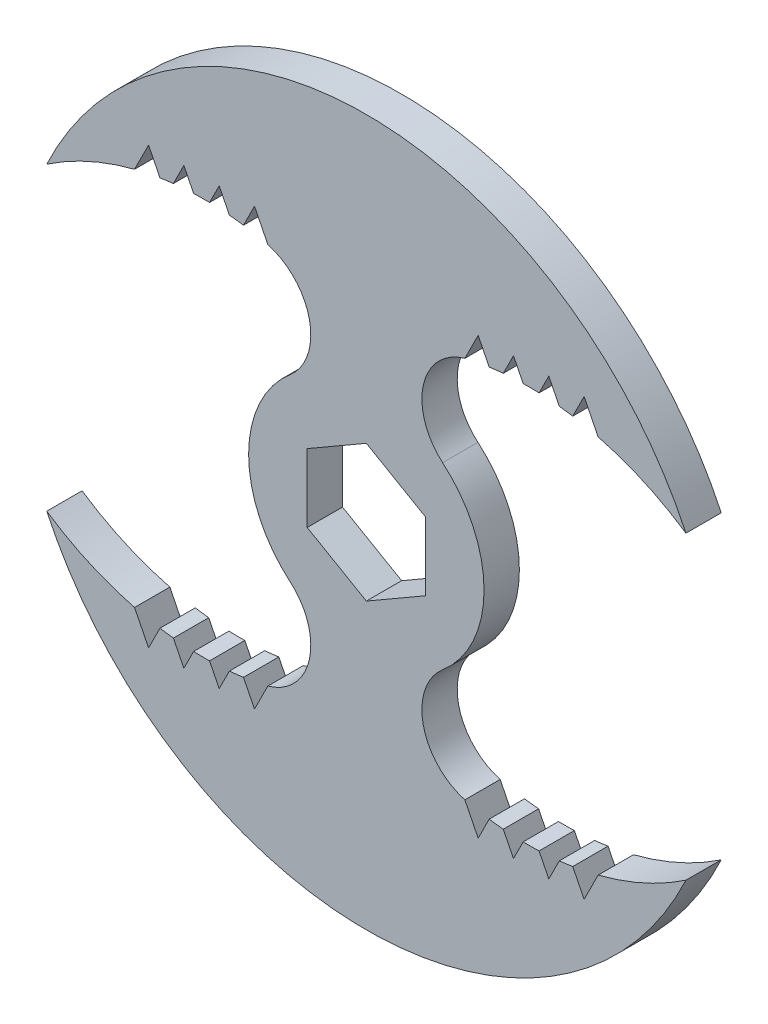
from build123d import *

# Parameters (mm, degrees)
EXTRUSION1_DEPTH = 6


with BuildPart() as part:
    # Esquisse1 → Extrusion1 (new body)
    with BuildSketch(Plane.XY):
        with BuildLine():
            Line((-39.38215805, -32.235673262), (-37, -37))
            Line((-37, -37), (-35.065337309, -33.130665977))
            ThreePointArc((-35.065337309, -33.130665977), (-33.924773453, -33.298625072), (-32.780488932, -33.439014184))
            Line((-32.780488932, -33.439014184), (-31, -37))
            Line((-31, -37), (-29.346737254, -33.693467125))
            ThreePointArc((-29.346737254, -33.693467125), (-27.993691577, -33.725621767), (-26.640278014, -33.719436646))
            Line((-26.640278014, -33.719436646), (-25, -37))
            Line((-25, -37), (-23.268454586, -33.536901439))
            ThreePointArc((-23.268454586, -33.536901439), (-22.067342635, -33.413880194), (-20.86972307, -33.26054551))
            Line((-20.86972307, -33.26054551), (-19, -37))
            Line((-19, -37), (-16.739345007, -32.478679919))
            ThreePointArc((-16.739345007, -32.478679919), (-9.670964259, -24.991046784), (-12.959380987, -15.233333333))
            ThreePointArc((-12.959380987, -15.233333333), (-20, 0), (-12.959380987, 15.233333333))
            ThreePointArc((-12.959380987, 15.233333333), (-9.670964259, 24.991046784), (-16.739345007, 32.478679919))
            Line((-16.739345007, 32.478679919), (-19, 37))
            Line((-19, 37), (-20.86972307, 33.26054551))
            ThreePointArc((-20.86972307, 33.26054551), (-22.067342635, 33.413880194), (-23.268454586, 33.536901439))
            Line((-23.268454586, 33.536901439), (-25, 37))
            Line((-25, 37), (-26.640278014, 33.719436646))
            ThreePointArc((-26.640278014, 33.719436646), (-27.993691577, 33.725621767), (-29.346737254, 33.693467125))
            Line((-29.346737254, 33.693467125), (-31, 37))
            Line((-31, 37), (-32.780488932, 33.439014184))
            ThreePointArc((-32.780488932, 33.439014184), (-33.924773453, 33.298625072), (-35.065337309, 33.130665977))
            Line((-35.065337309, 33.130665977), (-37, 37))
            Line((-37, 37), (-39.38215805, 32.235673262))
            ThreePointArc((-39.38215805, 32.235673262), (-47.129527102, 29.524791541), (-54.298537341, 25.527805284))
            ThreePointArc((-54.298537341, 25.527805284), (0, 60), (54.298537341, 25.527805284))
            ThreePointArc((54.298537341, 25.527805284), (47.129527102, 29.524791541), (39.38215805, 32.235673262))
            Line((39.38215805, 32.235673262), (37, 37))
            Line((37, 37), (35.065337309, 33.130665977))
            ThreePointArc((35.065337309, 33.130665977), (33.924773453, 33.298625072), (32.780488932, 33.439014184))
            Line((32.780488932, 33.439014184), (31, 37))
            Line((31, 37), (29.346737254, 33.693467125))
            ThreePointArc((29.346737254, 33.693467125), (27.993691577, 33.725621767), (26.640278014, 33.719436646))
            Line((26.640278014, 33.719436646), (25, 37))
            Line((25, 37), (23.268454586, 33.536901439))
            ThreePointArc((23.268454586, 33.536901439), (22.067342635, 33.413880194), (20.86972307, 33.26054551))
            Line((20.86972307, 33.26054551), (19, 37))
            Line((19, 37), (16.739345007, 32.478679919))
            ThreePointArc((16.739345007, 32.478679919), (9.670964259, 24.991046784), (12.959380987, 15.233333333))
            ThreePointArc((12.959380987, 15.233333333), (20, 0), (12.959380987, -15.233333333))
            ThreePointArc((12.959380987, -15.233333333), (9.670964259, -24.991046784), (16.739345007, -32.478679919))
            Line((16.739345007, -32.478679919), (19, -37))
            Line((19, -37), (20.86972307, -33.26054551))
            ThreePointArc((20.86972307, -33.26054551), (22.067342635, -33.413880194), (23.268454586, -33.536901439))
            Line((23.268454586, -33.536901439), (25, -37))
            Line((25, -37), (26.640278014, -33.719436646))
            ThreePointArc((26.640278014, -33.719436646), (27.993691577, -33.725621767), (29.346737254, -33.693467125))
            Line((29.346737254, -33.693467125), (31, -37))
            Line((31, -37), (32.780488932, -33.439014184))
            ThreePointArc((32.780488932, -33.439014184), (33.924773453, -33.298625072), (35.065337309, -33.130665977))
            Line((35.065337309, -33.130665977), (37, -37))
            Line((37, -37), (39.38215805, -32.235673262))
            ThreePointArc((39.38215805, -32.235673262), (47.129527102, -29.524791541), (54.298537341, -25.527805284))
            ThreePointArc((54.298537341, -25.527805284), (0, -60), (-54.298537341, -25.527805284))
            ThreePointArc((-54.298537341, -25.527805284), (-47.129527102, -29.524791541), (-39.38215805, -32.235673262))
        make_face()
        Polygon((0, 11.604740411), (-10.05, 5.802370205), (-10.05, -5.802370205), (0, -11.604740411), (10.05, -5.802370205), (10.05, 5.802370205), align=None, mode=Mode.SUBTRACT)
    extrude(amount=EXTRUSION1_DEPTH)


solid = part.part
